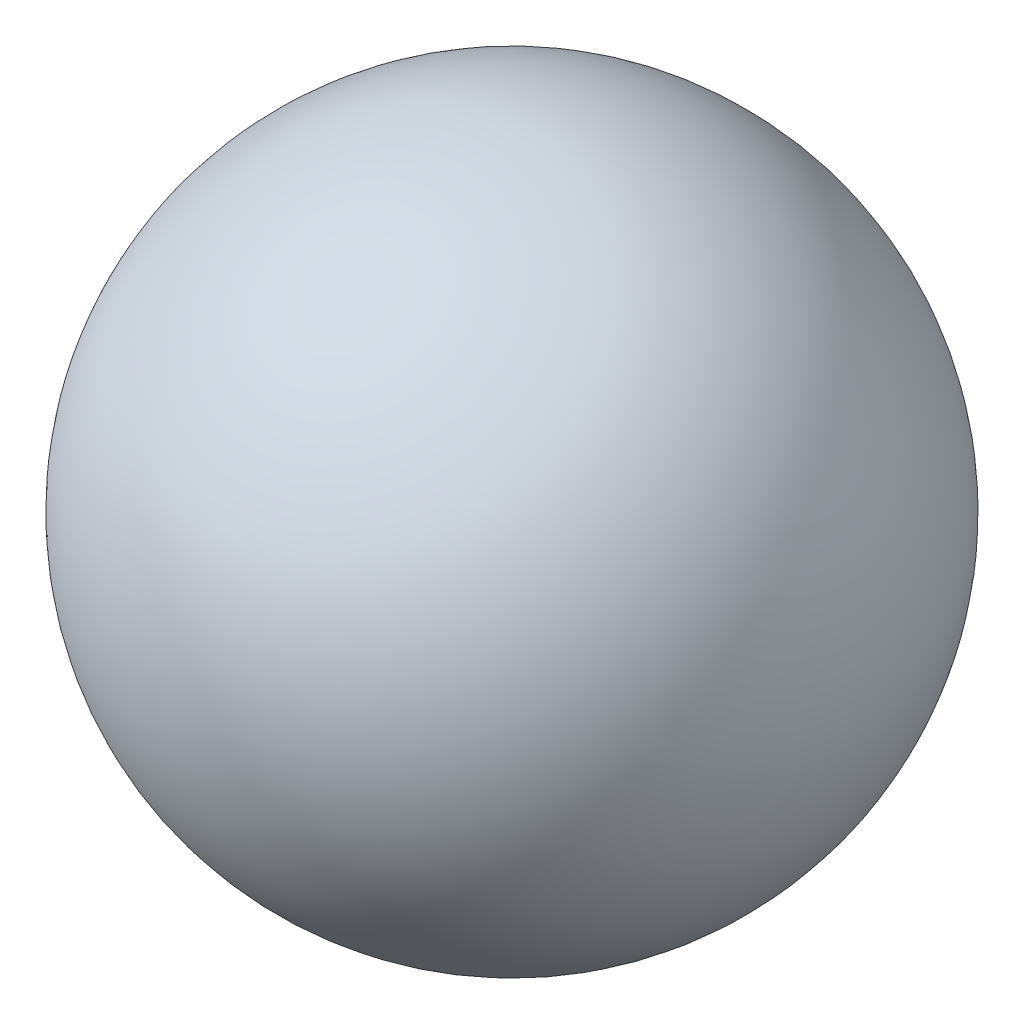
from build123d import *


with BuildPart() as part:
    # Esquisse1 → Base-R_volution (revolve)
    with BuildSketch(Plane.XY):
        with BuildLine():
            Line((0.75, 10), (6.75, 10))
            ThreePointArc((6.75, 10), (3.75, 7), (0.75, 10))
        make_face()
    revolve(axis=Axis((-1.379713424, 10, 0), (1, 0, 0)))


solid = part.part
